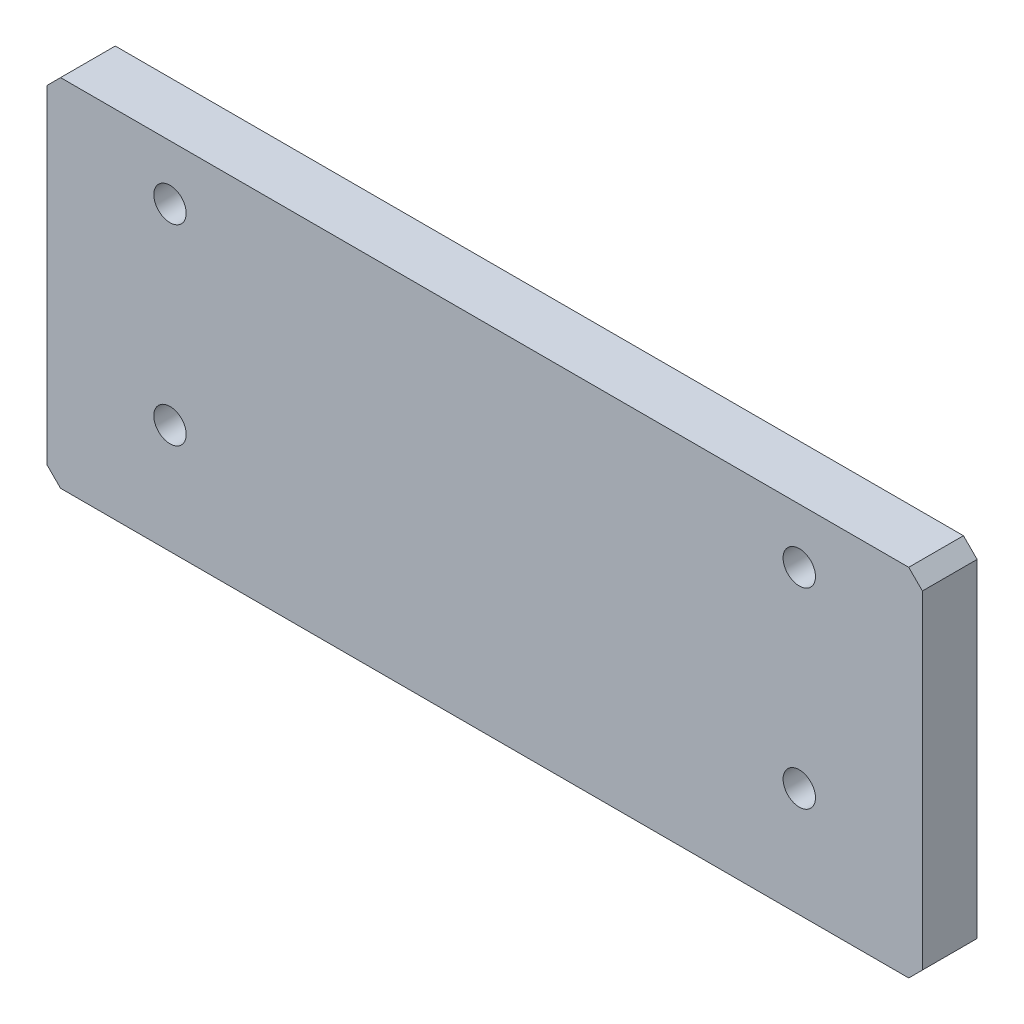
ISO-10303-21;
HEADER;
FILE_DESCRIPTION(('STEP AP214'),'2;1');
FILE_NAME('part.step','',(''),(''),'','','');
FILE_SCHEMA(('AUTOMOTIVE_DESIGN { 1 0 10303 214 1 1 1 1 }'));
ENDSEC;
DATA;
#1=APPLICATION_CONTEXT('core data for automotive mechanical design processes');
#2=APPLICATION_PROTOCOL_DEFINITION('international standard','automotive_design',2000,#1);
#3=PRODUCT_CONTEXT('',#1,'mechanical');
#4=PRODUCT('Part','Part','',(#3));
#5=PRODUCT_RELATED_PRODUCT_CATEGORY('part','',(#4));
#6=PRODUCT_DEFINITION_FORMATION('','',#4);
#7=PRODUCT_DEFINITION_CONTEXT('part definition',#1,'design');
#8=PRODUCT_DEFINITION('design','',#6,#7);
#9=PRODUCT_DEFINITION_SHAPE('','',#8);
#10=(LENGTH_UNIT() NAMED_UNIT(*) SI_UNIT(.MILLI.,.METRE.));
#11=(NAMED_UNIT(*) PLANE_ANGLE_UNIT() SI_UNIT($,.RADIAN.));
#12=(NAMED_UNIT(*) SI_UNIT($,.STERADIAN.) SOLID_ANGLE_UNIT());
#13=UNCERTAINTY_MEASURE_WITH_UNIT(LENGTH_MEASURE(1.E-05),#10,'distance_accuracy_value','');
#14=(GEOMETRIC_REPRESENTATION_CONTEXT(3) GLOBAL_UNCERTAINTY_ASSIGNED_CONTEXT((#13)) GLOBAL_UNIT_ASSIGNED_CONTEXT((#10,
#11,#12)) REPRESENTATION_CONTEXT('',''));
#15=CARTESIAN_POINT('',(0.,0.,0.));
#16=DIRECTION('',(0.,0.,1.));
#17=DIRECTION('',(1.,0.,0.));
#18=AXIS2_PLACEMENT_3D('',#15,#16,#17);
#19=CARTESIAN_POINT('',(126.180371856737,56.7108758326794,20.));
#20=DIRECTION('',(0.,0.,1.));
#21=DIRECTION('',(1.,0.,0.));
#22=AXIS2_PLACEMENT_3D('',#19,#20,#21);
#23=PLANE('',#22);
#24=CARTESIAN_POINT('',(241.180371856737,31.7108758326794,20.));
#25=DIRECTION('',(0.,0.,-1.));
#26=DIRECTION('',(-1.,0.,0.));
#27=AXIS2_PLACEMENT_3D('',#24,#25,#26);
#28=CIRCLE('',#27,5.9175);
#29=CARTESIAN_POINT('',(235.262871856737,31.7108758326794,20.));
#30=VERTEX_POINT('',#29);
#31=EDGE_CURVE('E150',#30,#30,#28,.T.);
#32=ORIENTED_EDGE('',*,*,#31,.T.);
#33=EDGE_LOOP('',(#32));
#34=FACE_BOUND('',#33,.T.);
#35=CARTESIAN_POINT('',(11.1803718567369,31.7108758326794,20.));
#36=DIRECTION('',(0.,0.,-1.));
#37=DIRECTION('',(-1.,0.,0.));
#38=AXIS2_PLACEMENT_3D('',#35,#36,#37);
#39=CIRCLE('',#38,5.9175);
#40=CARTESIAN_POINT('',(5.26287185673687,31.7108758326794,20.));
#41=VERTEX_POINT('',#40);
#42=EDGE_CURVE('E161',#41,#41,#39,.T.);
#43=ORIENTED_EDGE('',*,*,#42,.T.);
#44=EDGE_LOOP('',(#43));
#45=FACE_BOUND('',#44,.T.);
#46=CARTESIAN_POINT('',(11.1803718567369,101.710875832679,20.));
#47=DIRECTION('',(0.,0.,-1.));
#48=DIRECTION('',(-1.,0.,0.));
#49=AXIS2_PLACEMENT_3D('',#46,#47,#48);
#50=CIRCLE('',#49,5.9175);
#51=CARTESIAN_POINT('',(5.26287185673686,101.710875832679,20.));
#52=VERTEX_POINT('',#51);
#53=EDGE_CURVE('E163',#52,#52,#50,.T.);
#54=ORIENTED_EDGE('',*,*,#53,.T.);
#55=EDGE_LOOP('',(#54));
#56=FACE_BOUND('',#55,.T.);
#57=CARTESIAN_POINT('',(241.180371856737,101.710875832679,20.));
#58=DIRECTION('',(0.,0.,-1.));
#59=DIRECTION('',(-1.,0.,0.));
#60=AXIS2_PLACEMENT_3D('',#57,#58,#59);
#61=CIRCLE('',#60,5.91749999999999);
#62=CARTESIAN_POINT('',(235.262871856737,101.710875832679,20.));
#63=VERTEX_POINT('',#62);
#64=EDGE_CURVE('E20',#63,#63,#61,.T.);
#65=ORIENTED_EDGE('',*,*,#64,.T.);
#66=EDGE_LOOP('',(#65));
#67=FACE_BOUND('',#66,.T.);
#68=DIRECTION('',(0.707106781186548,-0.707106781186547,0.));
#69=VECTOR('',#68,1.);
#70=CARTESIAN_POINT('',(-31.3196281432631,-5.7891241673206,20.));
#71=LINE('',#70,#69);
#72=CARTESIAN_POINT('',(-28.8196281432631,-8.28912416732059,20.));
#73=VERTEX_POINT('',#72);
#74=CARTESIAN_POINT('',(-33.8196281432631,-3.2891241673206,20.));
#75=VERTEX_POINT('',#74);
#76=EDGE_CURVE('E117',#73,#75,#71,.F.);
#77=ORIENTED_EDGE('',*,*,#76,.F.);
#78=DIRECTION('',(1.,0.,0.));
#79=VECTOR('',#78,1.);
#80=CARTESIAN_POINT('',(286.180371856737,-8.28912416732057,20.));
#81=LINE('',#80,#79);
#82=CARTESIAN_POINT('',(281.180371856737,-8.28912416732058,20.));
#83=VERTEX_POINT('',#82);
#84=EDGE_CURVE('E121',#83,#73,#81,.F.);
#85=ORIENTED_EDGE('',*,*,#84,.F.);
#86=DIRECTION('',(0.707106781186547,0.707106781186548,0.));
#87=VECTOR('',#86,1.);
#88=CARTESIAN_POINT('',(283.680371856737,-5.78912416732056,20.));
#89=LINE('',#88,#87);
#90=CARTESIAN_POINT('',(286.180371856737,-3.28912416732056,20.));
#91=VERTEX_POINT('',#90);
#92=EDGE_CURVE('E65',#91,#83,#89,.F.);
#93=ORIENTED_EDGE('',*,*,#92,.F.);
#94=DIRECTION('',(0.,1.,0.));
#95=VECTOR('',#94,1.);
#96=CARTESIAN_POINT('',(286.180371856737,121.710875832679,20.));
#97=LINE('',#96,#95);
#98=CARTESIAN_POINT('',(286.180371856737,116.710875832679,20.));
#99=VERTEX_POINT('',#98);
#100=EDGE_CURVE('E72',#99,#91,#97,.F.);
#101=ORIENTED_EDGE('',*,*,#100,.F.);
#102=DIRECTION('',(-0.707106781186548,0.707106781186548,0.));
#103=VECTOR('',#102,1.);
#104=CARTESIAN_POINT('',(283.680371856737,119.210875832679,20.));
#105=LINE('',#104,#103);
#106=CARTESIAN_POINT('',(281.180371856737,121.710875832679,20.));
#107=VERTEX_POINT('',#106);
#108=EDGE_CURVE('E93',#107,#99,#105,.F.);
#109=ORIENTED_EDGE('',*,*,#108,.F.);
#110=DIRECTION('',(1.,0.,0.));
#111=VECTOR('',#110,1.);
#112=CARTESIAN_POINT('',(-33.8196281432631,121.710875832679,20.));
#113=LINE('',#112,#111);
#114=CARTESIAN_POINT('',(-28.8196281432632,121.710875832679,20.));
#115=VERTEX_POINT('',#114);
#116=EDGE_CURVE('E104',#115,#107,#113,.T.);
#117=ORIENTED_EDGE('',*,*,#116,.F.);
#118=DIRECTION('',(-0.707106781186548,-0.707106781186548,0.));
#119=VECTOR('',#118,1.);
#120=CARTESIAN_POINT('',(-31.3196281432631,119.210875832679,20.));
#121=LINE('',#120,#119);
#122=CARTESIAN_POINT('',(-33.8196281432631,116.710875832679,20.));
#123=VERTEX_POINT('',#122);
#124=EDGE_CURVE('E108',#123,#115,#121,.F.);
#125=ORIENTED_EDGE('',*,*,#124,.F.);
#126=DIRECTION('',(0.,1.,0.));
#127=VECTOR('',#126,1.);
#128=CARTESIAN_POINT('',(-33.8196281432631,-8.2891241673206,20.));
#129=LINE('',#128,#127);
#130=EDGE_CURVE('E114',#75,#123,#129,.T.);
#131=ORIENTED_EDGE('',*,*,#130,.F.);
#132=EDGE_LOOP('',(#77,#85,#93,#101,#109,#117,#125,#131));
#133=FACE_BOUND('',#132,.T.);
#134=ADVANCED_FACE('F16',(#34,#45,#56,#67,#133),#23,.T.);
#135=CARTESIAN_POINT('',(286.180371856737,121.710875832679,0.));
#136=DIRECTION('',(1.,0.,0.));
#137=DIRECTION('',(0.,0.,-1.));
#138=AXIS2_PLACEMENT_3D('',#135,#136,#137);
#139=PLANE('',#138);
#140=DIRECTION('',(0.,0.,1.));
#141=VECTOR('',#140,1.);
#142=CARTESIAN_POINT('',(286.180371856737,116.710875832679,0.));
#143=LINE('',#142,#141);
#144=CARTESIAN_POINT('',(286.180371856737,116.710875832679,0.));
#145=VERTEX_POINT('',#144);
#146=EDGE_CURVE('E96',#99,#145,#143,.F.);
#147=ORIENTED_EDGE('',*,*,#146,.F.);
#148=ORIENTED_EDGE('',*,*,#100,.T.);
#149=DIRECTION('',(0.,0.,1.));
#150=VECTOR('',#149,1.);
#151=CARTESIAN_POINT('',(286.180371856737,-3.28912416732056,0.));
#152=LINE('',#151,#150);
#153=CARTESIAN_POINT('',(286.180371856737,-3.28912416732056,0.));
#154=VERTEX_POINT('',#153);
#155=EDGE_CURVE('E126',#154,#91,#152,.T.);
#156=ORIENTED_EDGE('',*,*,#155,.F.);
#157=DIRECTION('',(0.,1.,0.));
#158=VECTOR('',#157,1.);
#159=CARTESIAN_POINT('',(286.180371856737,56.7108758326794,0.));
#160=LINE('',#159,#158);
#161=EDGE_CURVE('E59',#154,#145,#160,.T.);
#162=ORIENTED_EDGE('',*,*,#161,.T.);
#163=EDGE_LOOP('',(#147,#148,#156,#162));
#164=FACE_BOUND('',#163,.T.);
#165=ADVANCED_FACE('F103',(#164),#139,.T.);
#166=CARTESIAN_POINT('',(283.680371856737,119.210875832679,0.));
#167=DIRECTION('',(0.707106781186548,0.707106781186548,0.));
#168=DIRECTION('',(-0.707106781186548,0.707106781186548,0.));
#169=AXIS2_PLACEMENT_3D('',#166,#167,#168);
#170=PLANE('',#169);
#171=DIRECTION('',(-0.707106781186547,0.707106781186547,0.));
#172=VECTOR('',#171,1.);
#173=CARTESIAN_POINT('',(286.180371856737,116.710875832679,0.));
#174=LINE('',#173,#172);
#175=CARTESIAN_POINT('',(281.180371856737,121.710875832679,0.));
#176=VERTEX_POINT('',#175);
#177=EDGE_CURVE('E148',#145,#176,#174,.T.);
#178=ORIENTED_EDGE('',*,*,#177,.T.);
#179=DIRECTION('',(0.,0.,1.));
#180=VECTOR('',#179,1.);
#181=CARTESIAN_POINT('',(281.180371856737,121.710875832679,0.));
#182=LINE('',#181,#180);
#183=EDGE_CURVE('E97',#107,#176,#182,.F.);
#184=ORIENTED_EDGE('',*,*,#183,.F.);
#185=ORIENTED_EDGE('',*,*,#108,.T.);
#186=ORIENTED_EDGE('',*,*,#146,.T.);
#187=EDGE_LOOP('',(#178,#184,#185,#186));
#188=FACE_BOUND('',#187,.T.);
#189=ADVANCED_FACE('F95',(#188),#170,.T.);
#190=CARTESIAN_POINT('',(-33.8196281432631,121.710875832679,0.));
#191=DIRECTION('',(0.,1.,0.));
#192=DIRECTION('',(0.,0.,1.));
#193=AXIS2_PLACEMENT_3D('',#190,#191,#192);
#194=PLANE('',#193);
#195=ORIENTED_EDGE('',*,*,#183,.T.);
#196=DIRECTION('',(1.,0.,0.));
#197=VECTOR('',#196,1.);
#198=CARTESIAN_POINT('',(126.180371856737,121.710875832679,0.));
#199=LINE('',#198,#197);
#200=CARTESIAN_POINT('',(-28.8196281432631,121.710875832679,0.));
#201=VERTEX_POINT('',#200);
#202=EDGE_CURVE('E145',#176,#201,#199,.F.);
#203=ORIENTED_EDGE('',*,*,#202,.T.);
#204=DIRECTION('',(0.,0.,1.));
#205=VECTOR('',#204,1.);
#206=CARTESIAN_POINT('',(-28.8196281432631,121.710875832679,0.));
#207=LINE('',#206,#205);
#208=EDGE_CURVE('E110',#115,#201,#207,.F.);
#209=ORIENTED_EDGE('',*,*,#208,.F.);
#210=ORIENTED_EDGE('',*,*,#116,.T.);
#211=EDGE_LOOP('',(#195,#203,#209,#210));
#212=FACE_BOUND('',#211,.T.);
#213=ADVANCED_FACE('F210',(#212),#194,.T.);
#214=CARTESIAN_POINT('',(-31.3196281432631,119.210875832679,0.));
#215=DIRECTION('',(-0.707106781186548,0.707106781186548,0.));
#216=DIRECTION('',(-0.707106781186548,-0.707106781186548,0.));
#217=AXIS2_PLACEMENT_3D('',#214,#215,#216);
#218=PLANE('',#217);
#219=DIRECTION('',(-0.707106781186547,-0.707106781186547,0.));
#220=VECTOR('',#219,1.);
#221=CARTESIAN_POINT('',(-28.8196281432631,121.710875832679,0.));
#222=LINE('',#221,#220);
#223=CARTESIAN_POINT('',(-33.8196281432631,116.710875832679,0.));
#224=VERTEX_POINT('',#223);
#225=EDGE_CURVE('E142',#201,#224,#222,.T.);
#226=ORIENTED_EDGE('',*,*,#225,.T.);
#227=DIRECTION('',(0.,0.,1.));
#228=VECTOR('',#227,1.);
#229=CARTESIAN_POINT('',(-33.8196281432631,116.710875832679,0.));
#230=LINE('',#229,#228);
#231=EDGE_CURVE('E112',#123,#224,#230,.F.);
#232=ORIENTED_EDGE('',*,*,#231,.F.);
#233=ORIENTED_EDGE('',*,*,#124,.T.);
#234=ORIENTED_EDGE('',*,*,#208,.T.);
#235=EDGE_LOOP('',(#226,#232,#233,#234));
#236=FACE_BOUND('',#235,.T.);
#237=ADVANCED_FACE('F206',(#236),#218,.T.);
#238=CARTESIAN_POINT('',(-33.8196281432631,-8.2891241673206,0.));
#239=DIRECTION('',(-1.,0.,0.));
#240=DIRECTION('',(0.,0.,1.));
#241=AXIS2_PLACEMENT_3D('',#238,#239,#240);
#242=PLANE('',#241);
#243=DIRECTION('',(0.,0.,1.));
#244=VECTOR('',#243,1.);
#245=CARTESIAN_POINT('',(-33.8196281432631,-3.28912416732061,0.));
#246=LINE('',#245,#244);
#247=CARTESIAN_POINT('',(-33.8196281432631,-3.2891241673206,0.));
#248=VERTEX_POINT('',#247);
#249=EDGE_CURVE('E119',#75,#248,#246,.F.);
#250=ORIENTED_EDGE('',*,*,#249,.F.);
#251=ORIENTED_EDGE('',*,*,#130,.T.);
#252=ORIENTED_EDGE('',*,*,#231,.T.);
#253=DIRECTION('',(0.,1.,0.));
#254=VECTOR('',#253,1.);
#255=CARTESIAN_POINT('',(-33.8196281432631,56.7108758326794,0.));
#256=LINE('',#255,#254);
#257=EDGE_CURVE('E139',#224,#248,#256,.F.);
#258=ORIENTED_EDGE('',*,*,#257,.T.);
#259=EDGE_LOOP('',(#250,#251,#252,#258));
#260=FACE_BOUND('',#259,.T.);
#261=ADVANCED_FACE('F202',(#260),#242,.T.);
#262=CARTESIAN_POINT('',(-31.3196281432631,-5.7891241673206,0.));
#263=DIRECTION('',(-0.707106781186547,-0.707106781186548,0.));
#264=DIRECTION('',(0.707106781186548,-0.707106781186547,0.));
#265=AXIS2_PLACEMENT_3D('',#262,#263,#264);
#266=PLANE('',#265);
#267=DIRECTION('',(0.707106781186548,-0.707106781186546,0.));
#268=VECTOR('',#267,1.);
#269=CARTESIAN_POINT('',(-33.8196281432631,-3.28912416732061,0.));
#270=LINE('',#269,#268);
#271=CARTESIAN_POINT('',(-28.8196281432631,-8.28912416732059,0.));
#272=VERTEX_POINT('',#271);
#273=EDGE_CURVE('E136',#248,#272,#270,.T.);
#274=ORIENTED_EDGE('',*,*,#273,.T.);
#275=DIRECTION('',(0.,0.,-1.));
#276=VECTOR('',#275,1.);
#277=CARTESIAN_POINT('',(-28.8196281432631,-8.28912416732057,0.));
#278=LINE('',#277,#276);
#279=EDGE_CURVE('E123',#73,#272,#278,.T.);
#280=ORIENTED_EDGE('',*,*,#279,.F.);
#281=ORIENTED_EDGE('',*,*,#76,.T.);
#282=ORIENTED_EDGE('',*,*,#249,.T.);
#283=EDGE_LOOP('',(#274,#280,#281,#282));
#284=FACE_BOUND('',#283,.T.);
#285=ADVANCED_FACE('F198',(#284),#266,.T.);
#286=CARTESIAN_POINT('',(286.180371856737,-8.28912416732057,0.));
#287=DIRECTION('',(0.,-1.,0.));
#288=DIRECTION('',(0.,0.,-1.));
#289=AXIS2_PLACEMENT_3D('',#286,#287,#288);
#290=PLANE('',#289);
#291=ORIENTED_EDGE('',*,*,#279,.T.);
#292=DIRECTION('',(1.,0.,0.));
#293=VECTOR('',#292,1.);
#294=CARTESIAN_POINT('',(126.180371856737,-8.2891241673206,0.));
#295=LINE('',#294,#293);
#296=CARTESIAN_POINT('',(281.180371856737,-8.28912416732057,0.));
#297=VERTEX_POINT('',#296);
#298=EDGE_CURVE('E133',#272,#297,#295,.T.);
#299=ORIENTED_EDGE('',*,*,#298,.T.);
#300=DIRECTION('',(0.,0.,1.));
#301=VECTOR('',#300,1.);
#302=CARTESIAN_POINT('',(281.180371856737,-8.28912416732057,0.));
#303=LINE('',#302,#301);
#304=EDGE_CURVE('E35',#83,#297,#303,.F.);
#305=ORIENTED_EDGE('',*,*,#304,.F.);
#306=ORIENTED_EDGE('',*,*,#84,.T.);
#307=EDGE_LOOP('',(#291,#299,#305,#306));
#308=FACE_BOUND('',#307,.T.);
#309=ADVANCED_FACE('F184',(#308),#290,.T.);
#310=CARTESIAN_POINT('',(283.680371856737,-5.78912416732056,0.));
#311=DIRECTION('',(0.707106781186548,-0.707106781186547,0.));
#312=DIRECTION('',(0.707106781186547,0.707106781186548,0.));
#313=AXIS2_PLACEMENT_3D('',#310,#311,#312);
#314=PLANE('',#313);
#315=DIRECTION('',(0.707106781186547,0.707106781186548,0.));
#316=VECTOR('',#315,1.);
#317=CARTESIAN_POINT('',(281.180371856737,-8.28912416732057,0.));
#318=LINE('',#317,#316);
#319=EDGE_CURVE('E130',#297,#154,#318,.T.);
#320=ORIENTED_EDGE('',*,*,#319,.T.);
#321=ORIENTED_EDGE('',*,*,#155,.T.);
#322=ORIENTED_EDGE('',*,*,#92,.T.);
#323=ORIENTED_EDGE('',*,*,#304,.T.);
#324=EDGE_LOOP('',(#320,#321,#322,#323));
#325=FACE_BOUND('',#324,.T.);
#326=ADVANCED_FACE('F174',(#325),#314,.T.);
#327=CARTESIAN_POINT('',(241.180371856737,101.710875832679,20.));
#328=DIRECTION('',(0.,0.,-1.));
#329=DIRECTION('',(-1.,0.,0.));
#330=AXIS2_PLACEMENT_3D('',#327,#328,#329);
#331=CYLINDRICAL_SURFACE('',#330,5.91749999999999);
#332=CARTESIAN_POINT('',(241.180371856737,101.710875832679,0.));
#333=DIRECTION('',(0.,0.,-1.));
#334=DIRECTION('',(-1.,0.,0.));
#335=AXIS2_PLACEMENT_3D('',#332,#333,#334);
#336=CIRCLE('',#335,5.91749999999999);
#337=CARTESIAN_POINT('',(235.262871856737,101.710875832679,0.));
#338=VERTEX_POINT('',#337);
#339=EDGE_CURVE('E132',#338,#338,#336,.T.);
#340=ORIENTED_EDGE('',*,*,#339,.T.);
#341=EDGE_LOOP('',(#340));
#342=FACE_BOUND('',#341,.T.);
#343=ORIENTED_EDGE('',*,*,#64,.F.);
#344=EDGE_LOOP('',(#343));
#345=FACE_BOUND('',#344,.T.);
#346=ADVANCED_FACE('F171',(#342,#345),#331,.F.);
#347=CARTESIAN_POINT('',(11.1803718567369,101.710875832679,20.));
#348=DIRECTION('',(0.,0.,-1.));
#349=DIRECTION('',(-1.,0.,0.));
#350=AXIS2_PLACEMENT_3D('',#347,#348,#349);
#351=CYLINDRICAL_SURFACE('',#350,5.9175);
#352=CARTESIAN_POINT('',(11.1803718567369,101.710875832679,0.));
#353=DIRECTION('',(0.,0.,-1.));
#354=DIRECTION('',(-1.,0.,0.));
#355=AXIS2_PLACEMENT_3D('',#352,#353,#354);
#356=CIRCLE('',#355,5.9175);
#357=CARTESIAN_POINT('',(5.26287185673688,101.710875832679,0.));
#358=VERTEX_POINT('',#357);
#359=EDGE_CURVE('E154',#358,#358,#356,.T.);
#360=ORIENTED_EDGE('',*,*,#359,.T.);
#361=EDGE_LOOP('',(#360));
#362=FACE_BOUND('',#361,.T.);
#363=ORIENTED_EDGE('',*,*,#53,.F.);
#364=EDGE_LOOP('',(#363));
#365=FACE_BOUND('',#364,.T.);
#366=ADVANCED_FACE('F173',(#362,#365),#351,.F.);
#367=CARTESIAN_POINT('',(11.1803718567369,31.7108758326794,20.));
#368=DIRECTION('',(0.,0.,-1.));
#369=DIRECTION('',(-1.,0.,0.));
#370=AXIS2_PLACEMENT_3D('',#367,#368,#369);
#371=CYLINDRICAL_SURFACE('',#370,5.9175);
#372=CARTESIAN_POINT('',(11.1803718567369,31.7108758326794,0.));
#373=DIRECTION('',(0.,0.,-1.));
#374=DIRECTION('',(-1.,0.,0.));
#375=AXIS2_PLACEMENT_3D('',#372,#373,#374);
#376=CIRCLE('',#375,5.9175);
#377=CARTESIAN_POINT('',(5.26287185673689,31.7108758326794,0.));
#378=VERTEX_POINT('',#377);
#379=EDGE_CURVE('E26',#378,#378,#376,.T.);
#380=ORIENTED_EDGE('',*,*,#379,.T.);
#381=EDGE_LOOP('',(#380));
#382=FACE_BOUND('',#381,.T.);
#383=ORIENTED_EDGE('',*,*,#42,.F.);
#384=EDGE_LOOP('',(#383));
#385=FACE_BOUND('',#384,.T.);
#386=ADVANCED_FACE('F180',(#382,#385),#371,.F.);
#387=CARTESIAN_POINT('',(241.180371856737,31.7108758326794,20.));
#388=DIRECTION('',(0.,0.,-1.));
#389=DIRECTION('',(-1.,0.,0.));
#390=AXIS2_PLACEMENT_3D('',#387,#388,#389);
#391=CYLINDRICAL_SURFACE('',#390,5.9175);
#392=CARTESIAN_POINT('',(241.180371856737,31.7108758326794,0.));
#393=DIRECTION('',(0.,0.,-1.));
#394=DIRECTION('',(-1.,0.,0.));
#395=AXIS2_PLACEMENT_3D('',#392,#393,#394);
#396=CIRCLE('',#395,5.9175);
#397=CARTESIAN_POINT('',(235.262871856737,31.7108758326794,0.));
#398=VERTEX_POINT('',#397);
#399=EDGE_CURVE('E10',#398,#398,#396,.T.);
#400=ORIENTED_EDGE('',*,*,#399,.T.);
#401=EDGE_LOOP('',(#400));
#402=FACE_BOUND('',#401,.T.);
#403=ORIENTED_EDGE('',*,*,#31,.F.);
#404=EDGE_LOOP('',(#403));
#405=FACE_BOUND('',#404,.T.);
#406=ADVANCED_FACE('F18',(#402,#405),#391,.F.);
#407=CARTESIAN_POINT('',(126.180371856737,56.7108758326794,0.));
#408=DIRECTION('',(0.,0.,1.));
#409=DIRECTION('',(1.,0.,0.));
#410=AXIS2_PLACEMENT_3D('',#407,#408,#409);
#411=PLANE('',#410);
#412=ORIENTED_EDGE('',*,*,#399,.F.);
#413=EDGE_LOOP('',(#412));
#414=FACE_BOUND('',#413,.T.);
#415=ORIENTED_EDGE('',*,*,#379,.F.);
#416=EDGE_LOOP('',(#415));
#417=FACE_BOUND('',#416,.T.);
#418=ORIENTED_EDGE('',*,*,#359,.F.);
#419=EDGE_LOOP('',(#418));
#420=FACE_BOUND('',#419,.T.);
#421=ORIENTED_EDGE('',*,*,#339,.F.);
#422=EDGE_LOOP('',(#421));
#423=FACE_BOUND('',#422,.T.);
#424=ORIENTED_EDGE('',*,*,#298,.F.);
#425=ORIENTED_EDGE('',*,*,#273,.F.);
#426=ORIENTED_EDGE('',*,*,#257,.F.);
#427=ORIENTED_EDGE('',*,*,#225,.F.);
#428=ORIENTED_EDGE('',*,*,#202,.F.);
#429=ORIENTED_EDGE('',*,*,#177,.F.);
#430=ORIENTED_EDGE('',*,*,#161,.F.);
#431=ORIENTED_EDGE('',*,*,#319,.F.);
#432=EDGE_LOOP('',(#424,#425,#426,#427,#428,#429,#430,#431));
#433=FACE_BOUND('',#432,.T.);
#434=ADVANCED_FACE('F187',(#414,#417,#420,#423,#433),#411,.F.);
#435=CLOSED_SHELL('',(#134,#165,#189,#213,#237,#261,#285,#309,#326,#346,#366,#386,#406,#434));
#436=MANIFOLD_SOLID_BREP('B1',#435);
#437=ADVANCED_BREP_SHAPE_REPRESENTATION('',(#18,#436),#14);
#438=SHAPE_DEFINITION_REPRESENTATION(#9,#437);
ENDSEC;
END-ISO-10303-21;
